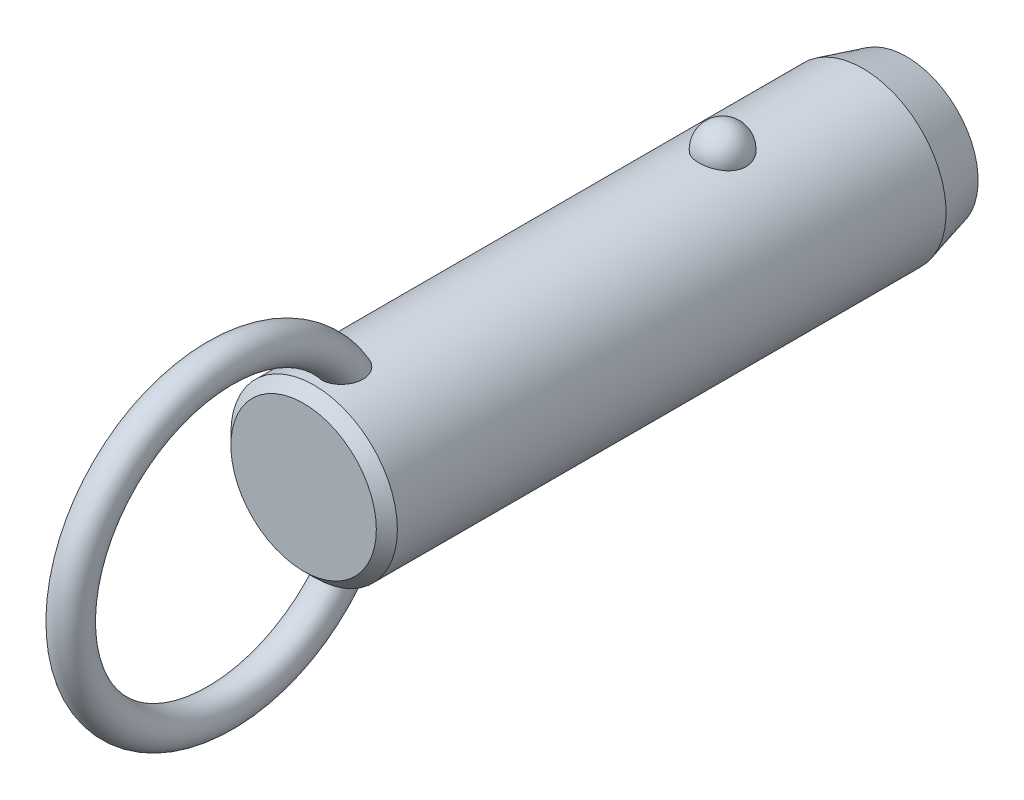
ISO-10303-21;
HEADER;
FILE_DESCRIPTION(('STEP AP214'),'2;1');
FILE_NAME('part.step','',(''),(''),'','','');
FILE_SCHEMA(('AUTOMOTIVE_DESIGN { 1 0 10303 214 1 1 1 1 }'));
ENDSEC;
DATA;
#1=APPLICATION_CONTEXT('core data for automotive mechanical design processes');
#2=APPLICATION_PROTOCOL_DEFINITION('international standard','automotive_design',2000,#1);
#3=PRODUCT_CONTEXT('',#1,'mechanical');
#4=PRODUCT('Part','Part','',(#3));
#5=PRODUCT_RELATED_PRODUCT_CATEGORY('part','',(#4));
#6=PRODUCT_DEFINITION_FORMATION('','',#4);
#7=PRODUCT_DEFINITION_CONTEXT('part definition',#1,'design');
#8=PRODUCT_DEFINITION('design','',#6,#7);
#9=PRODUCT_DEFINITION_SHAPE('','',#8);
#10=(LENGTH_UNIT() NAMED_UNIT(*) SI_UNIT(.MILLI.,.METRE.));
#11=(NAMED_UNIT(*) PLANE_ANGLE_UNIT() SI_UNIT($,.RADIAN.));
#12=(NAMED_UNIT(*) SI_UNIT($,.STERADIAN.) SOLID_ANGLE_UNIT());
#13=UNCERTAINTY_MEASURE_WITH_UNIT(LENGTH_MEASURE(1.E-05),#10,'distance_accuracy_value','');
#14=(GEOMETRIC_REPRESENTATION_CONTEXT(3) GLOBAL_UNCERTAINTY_ASSIGNED_CONTEXT((#13)) GLOBAL_UNIT_ASSIGNED_CONTEXT((#10,
#11,#12)) REPRESENTATION_CONTEXT('',''));
#15=CARTESIAN_POINT('',(0.,0.,0.));
#16=DIRECTION('',(0.,0.,1.));
#17=DIRECTION('',(1.,0.,0.));
#18=AXIS2_PLACEMENT_3D('',#15,#16,#17);
#19=CARTESIAN_POINT('',(0.,0.,35.6));
#20=DIRECTION('',(0.,0.,-1.));
#21=DIRECTION('',(-1.,0.,0.));
#22=AXIS2_PLACEMENT_3D('',#19,#20,#21);
#23=CYLINDRICAL_SURFACE('',#22,9.5);
#24=CARTESIAN_POINT('',(2.67259918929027,9.11631578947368,-2.7));
#25=CARTESIAN_POINT('',(2.6725968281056,9.11631786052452,-2.54909854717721));
#26=CARTESIAN_POINT('',(2.66030567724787,9.11994722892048,-2.39816735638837));
#27=CARTESIAN_POINT('',(2.6114347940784,9.13405924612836,-2.10058568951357));
#28=CARTESIAN_POINT('',(2.57484658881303,9.14454428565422,-1.95393672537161));
#29=CARTESIAN_POINT('',(2.47830875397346,9.17117631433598,-1.66916069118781));
#30=CARTESIAN_POINT('',(2.41836936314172,9.18732082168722,-1.53102991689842));
#31=CARTESIAN_POINT('',(2.27661331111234,9.22346780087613,-1.26705393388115));
#32=CARTESIAN_POINT('',(2.19479699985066,9.24347021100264,-1.14120852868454));
#33=CARTESIAN_POINT('',(2.01085282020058,9.28522401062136,-0.904632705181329));
#34=CARTESIAN_POINT('',(1.90862396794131,9.30698376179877,-0.793982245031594));
#35=CARTESIAN_POINT('',(1.6867437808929,9.34973971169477,-0.591607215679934));
#36=CARTESIAN_POINT('',(1.56709244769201,9.37073591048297,-0.499882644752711));
#37=CARTESIAN_POINT('',(1.31393976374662,9.40956370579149,-0.338167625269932));
#38=CARTESIAN_POINT('',(1.18048026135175,9.42740444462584,-0.268113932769));
#39=CARTESIAN_POINT('',(0.903154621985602,9.45799906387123,-0.151390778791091));
#40=CARTESIAN_POINT('',(0.759289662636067,9.47075351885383,-0.104718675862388));
#41=CARTESIAN_POINT('',(0.468074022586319,9.48956256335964,-0.0367633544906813));
#42=CARTESIAN_POINT('',(0.320836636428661,9.49573643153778,-0.0150275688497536));
#43=CARTESIAN_POINT('',(0.0246714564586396,9.50112183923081,0.00396199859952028));
#44=CARTESIAN_POINT('',(-0.124256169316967,9.50033406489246,0.00121819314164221));
#45=CARTESIAN_POINT('',(-0.417264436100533,9.4919475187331,-0.028444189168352));
#46=CARTESIAN_POINT('',(-0.561384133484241,9.48444885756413,-0.0550074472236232));
#47=CARTESIAN_POINT('',(-0.842986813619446,9.46357853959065,-0.131064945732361));
#48=CARTESIAN_POINT('',(-0.98046968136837,9.450206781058,-0.180559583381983));
#49=CARTESIAN_POINT('',(-1.24585005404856,9.41890822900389,-0.301476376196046));
#50=CARTESIAN_POINT('',(-1.37368611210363,9.40095498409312,-0.373026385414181));
#51=CARTESIAN_POINT('',(-1.61552738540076,9.3624296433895,-0.536025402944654));
#52=CARTESIAN_POINT('',(-1.72953116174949,9.34185727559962,-0.627476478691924));
#53=CARTESIAN_POINT('',(-1.9429225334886,9.29984568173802,-0.829844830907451));
#54=CARTESIAN_POINT('',(-2.04198021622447,9.27839736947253,-0.941108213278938));
#55=CARTESIAN_POINT('',(-2.2202646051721,9.23735994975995,-1.17883414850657));
#56=CARTESIAN_POINT('',(-2.29948985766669,9.21777097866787,-1.30529781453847));
#57=CARTESIAN_POINT('',(-2.43697287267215,9.18238994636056,-1.57158566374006));
#58=CARTESIAN_POINT('',(-2.49497068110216,9.16664569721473,-1.71155057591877));
#59=CARTESIAN_POINT('',(-2.5872073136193,9.14104303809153,-1.99961197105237));
#60=CARTESIAN_POINT('',(-2.62144683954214,9.13118445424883,-2.14770821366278));
#61=CARTESIAN_POINT('',(-2.66521466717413,9.11850622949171,-2.44715424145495));
#62=CARTESIAN_POINT('',(-2.67484831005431,9.11565658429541,-2.59848735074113));
#63=CARTESIAN_POINT('',(-2.66946735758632,9.11723375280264,-2.90067317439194));
#64=CARTESIAN_POINT('',(-2.65445345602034,9.12166036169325,-3.05152590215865));
#65=CARTESIAN_POINT('',(-2.6002971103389,9.13724422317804,-3.34766110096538));
#66=CARTESIAN_POINT('',(-2.56127978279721,9.14836656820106,-3.49296833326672));
#67=CARTESIAN_POINT('',(-2.46018844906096,9.17606676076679,-3.77477535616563));
#68=CARTESIAN_POINT('',(-2.39811349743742,9.19264483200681,-3.9112747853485));
#69=CARTESIAN_POINT('',(-2.25202303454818,9.22952198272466,-4.17244273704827));
#70=CARTESIAN_POINT('',(-2.16788714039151,9.24984129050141,-4.29704106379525));
#71=CARTESIAN_POINT('',(-1.9799408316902,9.29188255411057,-4.53013066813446));
#72=CARTESIAN_POINT('',(-1.87612963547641,9.31360456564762,-4.63862130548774));
#73=CARTESIAN_POINT('',(-1.65105429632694,9.35612959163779,-4.8369029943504));
#74=CARTESIAN_POINT('',(-1.52972405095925,9.37692871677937,-4.92661991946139));
#75=CARTESIAN_POINT('',(-1.27318250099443,9.41518970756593,-5.08429106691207));
#76=CARTESIAN_POINT('',(-1.13797219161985,9.432651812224,-5.15224684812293));
#77=CARTESIAN_POINT('',(-0.859280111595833,9.46208255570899,-5.26371827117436));
#78=CARTESIAN_POINT('',(-0.715925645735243,9.47411833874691,-5.30753421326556));
#79=CARTESIAN_POINT('',(-0.423550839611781,9.4916822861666,-5.37076321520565));
#80=CARTESIAN_POINT('',(-0.274531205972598,9.49721125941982,-5.39017930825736));
#81=CARTESIAN_POINT('',(0.0218446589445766,9.50110860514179,-5.40390587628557));
#82=CARTESIAN_POINT('',(0.169177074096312,9.49961381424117,-5.39869609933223));
#83=CARTESIAN_POINT('',(0.460808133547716,9.48993906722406,-5.3644195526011));
#84=CARTESIAN_POINT('',(0.605106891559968,9.48175936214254,-5.33535367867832));
#85=CARTESIAN_POINT('',(0.886027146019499,9.4596376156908,-5.2543558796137));
#86=CARTESIAN_POINT('',(1.02267710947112,9.44571881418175,-5.20251612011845));
#87=CARTESIAN_POINT('',(1.28523827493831,9.41358993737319,-5.07741549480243));
#88=CARTESIAN_POINT('',(1.41114877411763,9.39537958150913,-5.00415322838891));
#89=CARTESIAN_POINT('',(1.65085227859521,9.3562644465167,-4.83684599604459));
#90=CARTESIAN_POINT('',(1.76442346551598,9.33532178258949,-4.74249218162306));
#91=CARTESIAN_POINT('',(1.97425672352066,9.29321198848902,-4.53620389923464));
#92=CARTESIAN_POINT('',(2.07051582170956,9.27204482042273,-4.42426641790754));
#93=CARTESIAN_POINT('',(2.24490086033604,9.23139221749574,-4.18363183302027));
#94=CARTESIAN_POINT('',(2.32267019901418,9.21194380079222,-4.05466990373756));
#95=CARTESIAN_POINT('',(2.45584092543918,9.1773419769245,-3.78517836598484));
#96=CARTESIAN_POINT('',(2.51124979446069,9.16218713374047,-3.64465264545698));
#97=CARTESIAN_POINT('',(2.59380876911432,9.13913522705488,-3.37104301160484));
#98=CARTESIAN_POINT('',(2.62330266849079,9.13064624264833,-3.23871053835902));
#99=CARTESIAN_POINT('',(2.66269870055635,9.11923566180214,-2.97092664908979));
#100=CARTESIAN_POINT('',(2.67260130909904,9.11631393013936,-2.83547530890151));
#101=CARTESIAN_POINT('',(2.67259918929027,9.11631578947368,-2.7));
#102=B_SPLINE_CURVE_WITH_KNOTS('',3,(#24,#25,#26,#27,#28,#29,#30,#31,#32,#33,#34,#35,#36,#37,
#38,#39,#40,#41,#42,#43,#44,#45,#46,#47,#48,#49,#50,#51,#52,#53,#54,#55,#56,#57,#58,#59,#60,#61,
#62,#63,#64,#65,#66,#67,#68,#69,#70,#71,#72,#73,#74,#75,#76,#77,#78,#79,#80,#81,#82,#83,#84,#85,
#86,#87,#88,#89,#90,#91,#92,#93,#94,#95,#96,#97,#98,#99,#100,#101),.UNSPECIFIED.,.T.,.F.,(4,2,2,
2,2,2,2,2,2,2,2,2,2,2,2,2,2,2,2,2,2,2,2,2,2,2,2,2,2,2,2,2,2,2,2,2,2,2,4),(0.,0.452217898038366,
0.904593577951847,1.35677112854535,1.80894144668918,2.26340676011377,2.71787203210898,
3.17099820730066,3.62407318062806,4.0687883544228,4.51345969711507,4.95160616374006,
5.38976021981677,5.83050358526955,6.27129275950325,6.72071308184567,7.17016633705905,
7.62495278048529,8.07972578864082,8.53254856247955,8.98535859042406,9.43582813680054,
9.88631615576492,10.3393155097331,10.7923328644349,11.2471065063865,11.7018475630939,
12.1507959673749,12.5996885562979,13.0398725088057,13.4800399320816,13.9184421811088,
14.3568730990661,14.802202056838,15.2476074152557,15.7010097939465,16.1542603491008,
16.5602594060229,16.9662486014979),.UNSPECIFIED.);
#103=CARTESIAN_POINT('',(2.67259918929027,9.11631578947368,-2.7));
#104=VERTEX_POINT('',#103);
#105=EDGE_CURVE('E41',#104,#104,#102,.T.);
#106=ORIENTED_EDGE('',*,*,#105,.T.);
#107=EDGE_LOOP('',(#106));
#108=FACE_BOUND('',#107,.T.);
#109=CARTESIAN_POINT('',(0.,0.,43.92));
#110=DIRECTION('',(0.,0.,1.));
#111=DIRECTION('',(1.,0.,0.));
#112=AXIS2_PLACEMENT_3D('',#109,#110,#111);
#113=CIRCLE('',#112,9.5);
#114=CARTESIAN_POINT('',(9.5,0.,43.92));
#115=VERTEX_POINT('',#114);
#116=EDGE_CURVE('E10',#115,#115,#113,.F.);
#117=ORIENTED_EDGE('',*,*,#116,.T.);
#118=EDGE_LOOP('',(#117));
#119=FACE_BOUND('',#118,.T.);
#120=CARTESIAN_POINT('',(-0.697062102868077,-9.47439269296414,38.2678088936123));
#121=CARTESIAN_POINT('',(-0.799579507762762,-9.46685146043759,38.3074823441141));
#122=CARTESIAN_POINT('',(-0.898575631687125,-9.45788043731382,38.3559309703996));
#123=CARTESIAN_POINT('',(-1.08670047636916,-9.43811593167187,38.4688685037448));
#124=CARTESIAN_POINT('',(-1.17583204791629,-9.42732297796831,38.5333527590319));
#125=CARTESIAN_POINT('',(-1.34179806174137,-9.40513672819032,38.6762099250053));
#126=CARTESIAN_POINT('',(-1.41865133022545,-9.39374438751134,38.754561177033));
#127=CARTESIAN_POINT('',(-1.5586004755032,-9.37154196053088,38.9227524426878));
#128=CARTESIAN_POINT('',(-1.62169476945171,-9.3607319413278,39.0125937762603));
#129=CARTESIAN_POINT('',(-1.73527695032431,-9.34035749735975,39.2045001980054));
#130=CARTESIAN_POINT('',(-1.7852226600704,-9.33085270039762,39.3068910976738));
#131=CARTESIAN_POINT('',(-1.86924997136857,-9.3143834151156,39.518148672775));
#132=CARTESIAN_POINT('',(-1.90332570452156,-9.30741986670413,39.6270177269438));
#133=CARTESIAN_POINT('',(-1.95893603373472,-9.29588482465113,39.8604730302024));
#134=CARTESIAN_POINT('',(-1.97872420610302,-9.29165182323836,39.9854890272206));
#135=CARTESIAN_POINT('',(-2.00062129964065,-9.28695978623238,40.2370805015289));
#136=CARTESIAN_POINT('',(-2.00272284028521,-9.28650232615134,40.363656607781));
#137=CARTESIAN_POINT('',(-1.98958876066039,-9.28932750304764,40.6368157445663));
#138=CARTESIAN_POINT('',(-1.97143366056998,-9.2932400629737,40.7832519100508));
#139=CARTESIAN_POINT('',(-1.91479925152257,-9.30507151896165,41.0720629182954));
#140=CARTESIAN_POINT('',(-1.87629122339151,-9.31299607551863,41.214431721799));
#141=CARTESIAN_POINT('',(-1.7722568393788,-9.33340232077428,41.5151725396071));
#142=CARTESIAN_POINT('',(-1.70334898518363,-9.34641636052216,41.6723691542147));
#143=CARTESIAN_POINT('',(-1.58111062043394,-9.36759153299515,41.8975171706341));
#144=CARTESIAN_POINT('',(-1.53721459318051,-9.37492619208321,41.9707968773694));
#145=CARTESIAN_POINT('',(-1.4430263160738,-9.38988566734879,42.1130740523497));
#146=CARTESIAN_POINT('',(-1.39273721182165,-9.39751033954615,42.1820736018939));
#147=CARTESIAN_POINT('',(-1.26775962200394,-9.41530678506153,42.3369832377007));
#148=CARTESIAN_POINT('',(-1.19052326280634,-9.42548108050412,42.4208712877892));
#149=CARTESIAN_POINT('',(-1.0242024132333,-9.44499825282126,42.5760086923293));
#150=CARTESIAN_POINT('',(-0.935139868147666,-9.45434261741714,42.6472808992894));
#151=CARTESIAN_POINT('',(-0.766610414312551,-9.46930670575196,42.7586955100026));
#152=CARTESIAN_POINT('',(-0.689439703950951,-9.47529223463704,42.8022354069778));
#153=CARTESIAN_POINT('',(-0.528942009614,-9.48560294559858,42.8763133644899));
#154=CARTESIAN_POINT('',(-0.445620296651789,-9.48992953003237,42.9068624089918));
#155=CARTESIAN_POINT('',(-0.273901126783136,-9.49644161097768,42.9525792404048));
#156=CARTESIAN_POINT('',(-0.185465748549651,-9.49860811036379,42.96761059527));
#157=CARTESIAN_POINT('',(-0.00734541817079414,-9.5004135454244,42.9801494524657));
#158=CARTESIAN_POINT('',(0.082338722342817,-9.50005405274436,42.9776678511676));
#159=CARTESIAN_POINT('',(0.247679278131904,-9.49708301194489,42.9569959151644));
#160=CARTESIAN_POINT('',(0.323620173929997,-9.49477609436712,42.9409300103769));
#161=CARTESIAN_POINT('',(0.471981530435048,-9.48855917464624,42.8971726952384));
#162=CARTESIAN_POINT('',(0.544400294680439,-9.48464840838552,42.8694757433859));
#163=CARTESIAN_POINT('',(0.70894789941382,-9.47398336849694,42.7928026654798));
#164=CARTESIAN_POINT('',(0.799149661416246,-9.46671310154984,42.7397745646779));
#165=CARTESIAN_POINT('',(0.969783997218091,-9.45076225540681,42.6199731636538));
#166=CARTESIAN_POINT('',(1.05019415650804,-9.44207854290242,42.5531692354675));
#167=CARTESIAN_POINT('',(1.23092343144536,-9.42051459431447,42.3807596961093));
#168=CARTESIAN_POINT('',(1.32652499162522,-9.40733378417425,42.2702619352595));
#169=CARTESIAN_POINT('',(1.49893121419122,-9.38140745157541,42.0355614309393));
#170=CARTESIAN_POINT('',(1.57571616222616,-9.36866239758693,41.9113445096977));
#171=CARTESIAN_POINT('',(1.71285426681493,-9.34457644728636,41.6493891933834));
#172=CARTESIAN_POINT('',(1.77266365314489,-9.33328726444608,41.5113623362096));
#173=CARTESIAN_POINT('',(1.87239208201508,-9.31379209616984,41.2280515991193));
#174=CARTESIAN_POINT('',(1.91230158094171,-9.3055875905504,41.082764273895));
#175=CARTESIAN_POINT('',(1.9760418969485,-9.29228394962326,40.7620281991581));
#176=CARTESIAN_POINT('',(1.99587438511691,-9.28797202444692,40.5857248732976));
#177=CARTESIAN_POINT('',(2.0029570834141,-9.28645519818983,40.2324146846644));
#178=CARTESIAN_POINT('',(1.99025930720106,-9.28923895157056,40.0554093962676));
#179=CARTESIAN_POINT('',(1.93735479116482,-9.30038134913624,39.7563381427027));
#180=CARTESIAN_POINT('',(1.90576827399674,-9.30697680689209,39.6326679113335));
#181=CARTESIAN_POINT('',(1.82287484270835,-9.32356855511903,39.3923297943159));
#182=CARTESIAN_POINT('',(1.77158213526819,-9.33356239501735,39.2756569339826));
#183=CARTESIAN_POINT('',(1.64885744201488,-9.35602275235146,39.0527061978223));
#184=CARTESIAN_POINT('',(1.57730995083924,-9.36850332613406,38.9464927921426));
#185=CARTESIAN_POINT('',(1.41543264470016,-9.39431873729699,38.7495530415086));
#186=CARTESIAN_POINT('',(1.32510883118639,-9.40765330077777,38.6588217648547));
#187=CARTESIAN_POINT('',(1.13846223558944,-9.43195720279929,38.5050334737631));
#188=CARTESIAN_POINT('',(1.04369890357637,-9.44302894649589,38.4400947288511));
#189=CARTESIAN_POINT('',(0.843965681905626,-9.46296805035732,38.3280388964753));
#190=CARTESIAN_POINT('',(0.739000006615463,-9.4718363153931,38.2809144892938));
#191=CARTESIAN_POINT('',(0.528175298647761,-9.48586140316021,38.2081173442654));
#192=CARTESIAN_POINT('',(0.422686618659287,-9.49119633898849,38.1814024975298));
#193=CARTESIAN_POINT('',(0.208590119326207,-9.49831365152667,38.1460137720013));
#194=CARTESIAN_POINT('',(0.099981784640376,-9.500095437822,38.1373428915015));
#195=CARTESIAN_POINT('',(-0.126104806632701,-9.49988861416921,38.1383501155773));
#196=CARTESIAN_POINT('',(-0.24357872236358,-9.49757821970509,38.1495942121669));
#197=CARTESIAN_POINT('',(-0.474390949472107,-9.48885165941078,38.193167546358));
#198=CARTESIAN_POINT('',(-0.587729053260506,-9.48243528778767,38.2254978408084));
#199=CARTESIAN_POINT('',(-0.697062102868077,-9.47439269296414,38.2678088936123));
#200=B_SPLINE_CURVE_WITH_KNOTS('',3,(#120,#121,#122,#123,#124,#125,#126,#127,#128,#129,#130,
#131,#132,#133,#134,#135,#136,#137,#138,#139,#140,#141,#142,#143,#144,#145,#146,#147,#148,#149,
#150,#151,#152,#153,#154,#155,#156,#157,#158,#159,#160,#161,#162,#163,#164,#165,#166,#167,#168,
#169,#170,#171,#172,#173,#174,#175,#176,#177,#178,#179,#180,#181,#182,#183,#184,#185,#186,#187,
#188,#189,#190,#191,#192,#193,#194,#195,#196,#197,#198,#199),.UNSPECIFIED.,.T.,.F.,(4,2,2,2,2,2,
2,2,2,2,2,2,2,2,2,2,2,2,2,2,2,2,2,2,2,2,2,2,2,2,2,2,2,2,2,2,2,2,2,4),(0.,0.33011940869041,
0.660143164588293,0.98965593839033,1.31920659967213,1.66074728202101,2.00241415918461,
2.38088696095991,2.75951768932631,3.20065679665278,3.64242004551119,4.15620996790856,
4.41314162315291,4.66994734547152,5.01228664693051,5.35399933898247,5.61943037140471,
5.88463652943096,6.15215502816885,6.41950709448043,6.65144391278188,6.88349136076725,
7.19641200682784,7.5100360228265,7.94779711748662,8.38601491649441,8.83699707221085,
9.2881953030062,9.81778662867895,10.3465317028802,10.7284172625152,11.110028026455,
11.4938603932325,11.8775702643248,12.2220189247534,12.5663259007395,12.8915939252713,
13.2169159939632,13.5689650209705,13.9210316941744),.UNSPECIFIED.);
#201=CARTESIAN_POINT('',(-0.697062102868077,-9.47439269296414,38.2678088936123));
#202=VERTEX_POINT('',#201);
#203=EDGE_CURVE('E59',#202,#202,#200,.T.);
#204=ORIENTED_EDGE('',*,*,#203,.T.);
#205=EDGE_LOOP('',(#204));
#206=FACE_BOUND('',#205,.T.);
#207=CARTESIAN_POINT('',(-0.697062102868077,9.47439269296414,38.2678088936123));
#208=CARTESIAN_POINT('',(-0.597792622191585,9.48169483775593,38.2293956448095));
#209=CARTESIAN_POINT('',(-0.495106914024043,9.48766580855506,38.1991682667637));
#210=CARTESIAN_POINT('',(-0.285876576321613,9.49627648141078,38.1560327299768));
#211=CARTESIAN_POINT('',(-0.179324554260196,9.49890941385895,38.1431597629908));
#212=CARTESIAN_POINT('',(0.0344157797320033,9.50053798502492,38.1351666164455));
#213=CARTESIAN_POINT('',(0.141603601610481,9.49953613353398,38.1400341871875));
#214=CARTESIAN_POINT('',(0.35356357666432,9.49401038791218,38.1673654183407));
#215=CARTESIAN_POINT('',(0.458336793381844,9.48948807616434,38.18982117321));
#216=CARTESIAN_POINT('',(0.662493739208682,9.4774236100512,38.2516719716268));
#217=CARTESIAN_POINT('',(0.76188104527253,9.46988348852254,38.2910556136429));
#218=CARTESIAN_POINT('',(0.952608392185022,9.45260382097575,38.3856342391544));
#219=CARTESIAN_POINT('',(1.04394806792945,9.44286417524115,38.4408299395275));
#220=CARTESIAN_POINT('',(1.21712767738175,9.4221176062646,38.5660662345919));
#221=CARTESIAN_POINT('',(1.29885671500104,9.41109835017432,38.6362579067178));
#222=CARTESIAN_POINT('',(1.44978975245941,9.38903310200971,38.788980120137));
#223=CARTESIAN_POINT('',(1.51899278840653,9.37798710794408,38.8715116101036));
#224=CARTESIAN_POINT('',(1.64602857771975,9.35654375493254,39.0497763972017));
#225=CARTESIAN_POINT('',(1.70333052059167,9.34618688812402,39.1458916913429));
#226=CARTESIAN_POINT('',(1.80259341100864,9.32755128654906,39.345897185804));
#227=CARTESIAN_POINT('',(1.84454942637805,9.31927322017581,39.4497898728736));
#228=CARTESIAN_POINT('',(1.91637039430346,9.30478365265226,39.6722131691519));
#229=CARTESIAN_POINT('',(1.944805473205,9.29882552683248,39.7912192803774));
#230=CARTESIAN_POINT('',(1.98449865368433,9.29043398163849,40.0321436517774));
#231=CARTESIAN_POINT('',(1.99574908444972,9.28800213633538,40.1540631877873));
#232=CARTESIAN_POINT('',(2.00275141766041,9.28649645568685,40.4169324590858));
#233=CARTESIAN_POINT('',(1.99588238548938,9.28799035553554,40.5579529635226));
#234=CARTESIAN_POINT('',(1.96270559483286,9.29505517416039,40.8376217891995));
#235=CARTESIAN_POINT('',(1.93637872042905,9.30063010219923,40.976267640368));
#236=CARTESIAN_POINT('',(1.85949176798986,9.31633564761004,41.2725616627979));
#237=CARTESIAN_POINT('',(1.80549792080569,9.3270926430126,41.4292907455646));
#238=CARTESIAN_POINT('',(1.67376869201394,9.3516306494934,41.7322840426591));
#239=CARTESIAN_POINT('',(1.59603181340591,9.36541185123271,41.8785475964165));
#240=CARTESIAN_POINT('',(1.4360277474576,9.39110706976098,42.1258138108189));
#241=CARTESIAN_POINT('',(1.35831795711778,9.40278656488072,42.229791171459));
#242=CARTESIAN_POINT('',(1.18774483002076,9.42585025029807,42.4245347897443));
#243=CARTESIAN_POINT('',(1.09490932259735,9.43723493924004,42.5153247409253));
#244=CARTESIAN_POINT('',(0.921110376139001,9.45552616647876,42.6562033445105));
#245=CARTESIAN_POINT('',(0.843738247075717,9.46281058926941,42.7106563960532));
#246=CARTESIAN_POINT('',(0.681245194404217,9.47589120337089,42.8067117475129));
#247=CARTESIAN_POINT('',(0.596135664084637,9.48168953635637,42.8483325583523));
#248=CARTESIAN_POINT('',(0.433779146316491,9.49038144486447,42.9100899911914));
#249=CARTESIAN_POINT('',(0.357459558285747,9.49359170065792,42.9326013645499));
#250=CARTESIAN_POINT('',(0.20207411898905,9.49816761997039,42.9645745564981));
#251=CARTESIAN_POINT('',(0.123010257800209,9.49953459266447,42.9740456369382));
#252=CARTESIAN_POINT('',(-0.0357372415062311,9.50026497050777,42.9791143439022));
#253=CARTESIAN_POINT('',(-0.115421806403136,9.49962433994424,42.9746840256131));
#254=CARTESIAN_POINT('',(-0.272823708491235,9.49640854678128,42.9522962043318));
#255=CARTESIAN_POINT('',(-0.350540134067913,9.4938325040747,42.9343325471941));
#256=CARTESIAN_POINT('',(-0.500580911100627,9.4870946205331,42.8868028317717));
#257=CARTESIAN_POINT('',(-0.572979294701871,9.48296359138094,42.8574618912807));
#258=CARTESIAN_POINT('',(-0.712864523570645,9.47347609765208,42.7890087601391));
#259=CARTESIAN_POINT('',(-0.7803490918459,9.46811906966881,42.7498920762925));
#260=CARTESIAN_POINT('',(-0.94630921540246,9.45329720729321,42.639432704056));
#261=CARTESIAN_POINT('',(-1.04090230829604,9.44321512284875,42.5623297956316));
#262=CARTESIAN_POINT('',(-1.21661929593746,9.42219227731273,42.3940971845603));
#263=CARTESIAN_POINT('',(-1.29770519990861,9.41124921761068,42.3029292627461));
#264=CARTESIAN_POINT('',(-1.47319646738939,9.38563439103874,42.0761621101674));
#265=CARTESIAN_POINT('',(-1.5620887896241,9.37102009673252,41.9362895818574));
#266=CARTESIAN_POINT('',(-1.71623987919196,9.34401559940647,41.6439503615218));
#267=CARTESIAN_POINT('',(-1.78147866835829,9.33162728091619,41.4914731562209));
#268=CARTESIAN_POINT('',(-1.88853837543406,9.31055541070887,41.1756470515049));
#269=CARTESIAN_POINT('',(-1.92998995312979,9.30193076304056,41.0121685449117));
#270=CARTESIAN_POINT('',(-1.98590726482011,9.29015757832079,40.6805268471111));
#271=CARTESIAN_POINT('',(-2.0004070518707,9.2870021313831,40.5123698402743));
#272=CARTESIAN_POINT('',(-1.99964701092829,9.28716218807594,40.2050806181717));
#273=CARTESIAN_POINT('',(-1.98908145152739,9.28945704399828,40.0659362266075));
#274=CARTESIAN_POINT('',(-1.94566294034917,9.29865169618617,39.7911539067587));
#275=CARTESIAN_POINT('',(-1.91282062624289,9.30554929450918,39.655514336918));
#276=CARTESIAN_POINT('',(-1.84582133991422,9.31898248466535,39.4578026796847));
#277=CARTESIAN_POINT('',(-1.8203808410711,9.32400364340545,39.392583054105));
#278=CARTESIAN_POINT('',(-1.7635051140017,9.33492884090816,39.2649033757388));
#279=CARTESIAN_POINT('',(-1.7320730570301,9.34083241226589,39.2024418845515));
#280=CARTESIAN_POINT('',(-1.66324243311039,9.353333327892,39.0809407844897));
#281=CARTESIAN_POINT('',(-1.62584239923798,9.35993084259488,39.0219020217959));
#282=CARTESIAN_POINT('',(-1.54527678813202,9.37356864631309,38.9079875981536));
#283=CARTESIAN_POINT('',(-1.50211241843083,9.38060884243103,38.8531110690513));
#284=CARTESIAN_POINT('',(-1.37681147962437,9.40004442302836,38.7099619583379));
#285=CARTESIAN_POINT('',(-1.28916358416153,9.41261047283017,38.6264295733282));
#286=CARTESIAN_POINT('',(-1.09996826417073,9.43658180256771,38.4772360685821));
#287=CARTESIAN_POINT('',(-0.998461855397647,9.44799034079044,38.4115238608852));
#288=CARTESIAN_POINT('',(-0.860188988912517,9.46103017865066,38.3394367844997));
#289=CARTESIAN_POINT('',(-0.828141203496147,9.46389141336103,38.3238511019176));
#290=CARTESIAN_POINT('',(-0.763210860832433,9.46934915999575,38.2944734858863));
#291=CARTESIAN_POINT('',(-0.730328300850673,9.47194567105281,38.2806815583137));
#292=CARTESIAN_POINT('',(-0.697062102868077,9.47439269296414,38.2678088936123));
#293=B_SPLINE_CURVE_WITH_KNOTS('',3,(#207,#208,#209,#210,#211,#212,#213,#214,#215,#216,#217,
#218,#219,#220,#221,#222,#223,#224,#225,#226,#227,#228,#229,#230,#231,#232,#233,#234,#235,#236,
#237,#238,#239,#240,#241,#242,#243,#244,#245,#246,#247,#248,#249,#250,#251,#252,#253,#254,#255,
#256,#257,#258,#259,#260,#261,#262,#263,#264,#265,#266,#267,#268,#269,#270,#271,#272,#273,#274,
#275,#276,#277,#278,#279,#280,#281,#282,#283,#284,#285,#286,#287,#288,#289,#290,#291,#292),
.UNSPECIFIED.,.T.,.F.,(4,2,2,2,2,2,2,2,2,2,2,2,2,2,2,2,2,2,2,2,2,2,2,2,2,2,2,2,2,2,2,2,2,2,2,2,
2,2,2,2,2,2,4),(0.,0.319942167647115,0.640532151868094,0.960900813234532,1.28112555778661,
1.60113495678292,1.92115886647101,2.24457323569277,2.56801248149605,2.90371927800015,
3.23953387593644,3.60560313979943,3.97183576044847,4.39383693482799,4.81625324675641,
5.31257045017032,5.80891895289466,6.19868344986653,6.58773876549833,6.87145417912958,
7.15475838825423,7.3926375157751,7.63034760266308,7.86853584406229,8.10683246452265,
8.3406366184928,8.57454843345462,8.93983939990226,9.30614105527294,9.80266668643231,
10.2996107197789,10.8040753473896,11.3079021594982,11.7249776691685,12.1418541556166,
12.3521485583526,12.562331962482,12.7725671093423,12.9827582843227,13.3458276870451,
13.7078449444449,13.8150604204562,13.9222762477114),.UNSPECIFIED.);
#294=CARTESIAN_POINT('',(-0.697062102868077,9.47439269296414,38.2678088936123));
#295=VERTEX_POINT('',#294);
#296=EDGE_CURVE('E67',#295,#295,#293,.T.);
#297=ORIENTED_EDGE('',*,*,#296,.T.);
#298=EDGE_LOOP('',(#297));
#299=FACE_BOUND('',#298,.T.);
#300=CARTESIAN_POINT('',(0.,0.,-18.7));
#301=DIRECTION('',(0.,0.,-1.));
#302=DIRECTION('',(-1.,0.,0.));
#303=AXIS2_PLACEMENT_3D('',#300,#301,#302);
#304=CIRCLE('',#303,9.5);
#305=CARTESIAN_POINT('',(-9.5,0.,-18.7));
#306=VERTEX_POINT('',#305);
#307=EDGE_CURVE('E56',#306,#306,#304,.F.);
#308=ORIENTED_EDGE('',*,*,#307,.T.);
#309=EDGE_LOOP('',(#308));
#310=FACE_BOUND('',#309,.T.);
#311=ADVANCED_FACE('F37',(#108,#119,#206,#299,#310),#23,.T.);
#312=CARTESIAN_POINT('',(0.,0.,-23.7));
#313=DIRECTION('',(0.,0.,-1.));
#314=DIRECTION('',(-1.,0.,0.));
#315=AXIS2_PLACEMENT_3D('',#312,#313,#314);
#316=PLANE('',#315);
#317=CARTESIAN_POINT('',(0.,0.,-23.7));
#318=DIRECTION('',(0.,0.,-1.));
#319=DIRECTION('',(-1.,0.,0.));
#320=AXIS2_PLACEMENT_3D('',#317,#318,#319);
#321=CIRCLE('',#320,8.16025403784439);
#322=CARTESIAN_POINT('',(-8.16025403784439,0.,-23.7));
#323=VERTEX_POINT('',#322);
#324=EDGE_CURVE('E66',#323,#323,#321,.T.);
#325=ORIENTED_EDGE('',*,*,#324,.T.);
#326=EDGE_LOOP('',(#325));
#327=FACE_BOUND('',#326,.T.);
#328=ADVANCED_FACE('F85',(#327),#316,.T.);
#329=CARTESIAN_POINT('',(0.,0.,-23.7));
#330=DIRECTION('',(0.,0.,1.));
#331=DIRECTION('',(1.,0.,0.));
#332=AXIS2_PLACEMENT_3D('',#329,#330,#331);
#333=CONICAL_SURFACE('',#332,8.16025403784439,0.261799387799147);
#334=ORIENTED_EDGE('',*,*,#307,.F.);
#335=EDGE_LOOP('',(#334));
#336=FACE_BOUND('',#335,.T.);
#337=ORIENTED_EDGE('',*,*,#324,.F.);
#338=EDGE_LOOP('',(#337));
#339=FACE_BOUND('',#338,.T.);
#340=ADVANCED_FACE('F83',(#336,#339),#333,.T.);
#341=CARTESIAN_POINT('',(0.,0.,45.12));
#342=DIRECTION('',(0.,0.,1.));
#343=DIRECTION('',(1.,0.,0.));
#344=AXIS2_PLACEMENT_3D('',#341,#342,#343);
#345=PLANE('',#344);
#346=CARTESIAN_POINT('',(0.,0.,45.12));
#347=DIRECTION('',(0.,0.,1.));
#348=DIRECTION('',(1.,0.,0.));
#349=AXIS2_PLACEMENT_3D('',#346,#347,#348);
#350=CIRCLE('',#349,8.3);
#351=CARTESIAN_POINT('',(8.3,0.,45.12));
#352=VERTEX_POINT('',#351);
#353=EDGE_CURVE('E50',#352,#352,#350,.T.);
#354=ORIENTED_EDGE('',*,*,#353,.T.);
#355=EDGE_LOOP('',(#354));
#356=FACE_BOUND('',#355,.T.);
#357=ADVANCED_FACE('F77',(#356),#345,.T.);
#358=CARTESIAN_POINT('',(0.,0.,54.65));
#359=DIRECTION('',(1.,0.,0.));
#360=DIRECTION('',(0.,0.,-1.));
#361=AXIS2_PLACEMENT_3D('',#358,#359,#360);
#362=TOROIDAL_SURFACE('',#361,17.05,2.);
#363=ORIENTED_EDGE('',*,*,#296,.F.);
#364=EDGE_LOOP('',(#363));
#365=FACE_BOUND('',#364,.T.);
#366=ORIENTED_EDGE('',*,*,#203,.F.);
#367=EDGE_LOOP('',(#366));
#368=FACE_BOUND('',#367,.T.);
#369=ADVANCED_FACE('F73',(#365,#368),#362,.T.);
#370=CARTESIAN_POINT('',(0.,0.,45.12));
#371=DIRECTION('',(0.,0.,-1.));
#372=DIRECTION('',(-1.,0.,0.));
#373=AXIS2_PLACEMENT_3D('',#370,#371,#372);
#374=CONICAL_SURFACE('',#373,8.3,0.785398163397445);
#375=ORIENTED_EDGE('',*,*,#116,.F.);
#376=EDGE_LOOP('',(#375));
#377=FACE_BOUND('',#376,.T.);
#378=ORIENTED_EDGE('',*,*,#353,.F.);
#379=EDGE_LOOP('',(#378));
#380=FACE_BOUND('',#379,.T.);
#381=ADVANCED_FACE('F39',(#377,#380),#374,.T.);
#382=CARTESIAN_POINT('',(0.,9.5,-2.7));
#383=DIRECTION('',(0.,1.,0.));
#384=DIRECTION('',(0.,0.,-1.));
#385=AXIS2_PLACEMENT_3D('',#382,#383,#384);
#386=SPHERICAL_SURFACE('',#385,2.7);
#387=ORIENTED_EDGE('',*,*,#105,.F.);
#388=EDGE_LOOP('',(#387));
#389=FACE_BOUND('',#388,.T.);
#390=ADVANCED_FACE('F79',(#389),#386,.T.);
#391=CLOSED_SHELL('',(#311,#328,#340,#357,#369,#381,#390));
#392=MANIFOLD_SOLID_BREP('B2',#391);
#393=ADVANCED_BREP_SHAPE_REPRESENTATION('',(#18,#392),#14);
#394=SHAPE_DEFINITION_REPRESENTATION(#9,#393);
ENDSEC;
END-ISO-10303-21;
